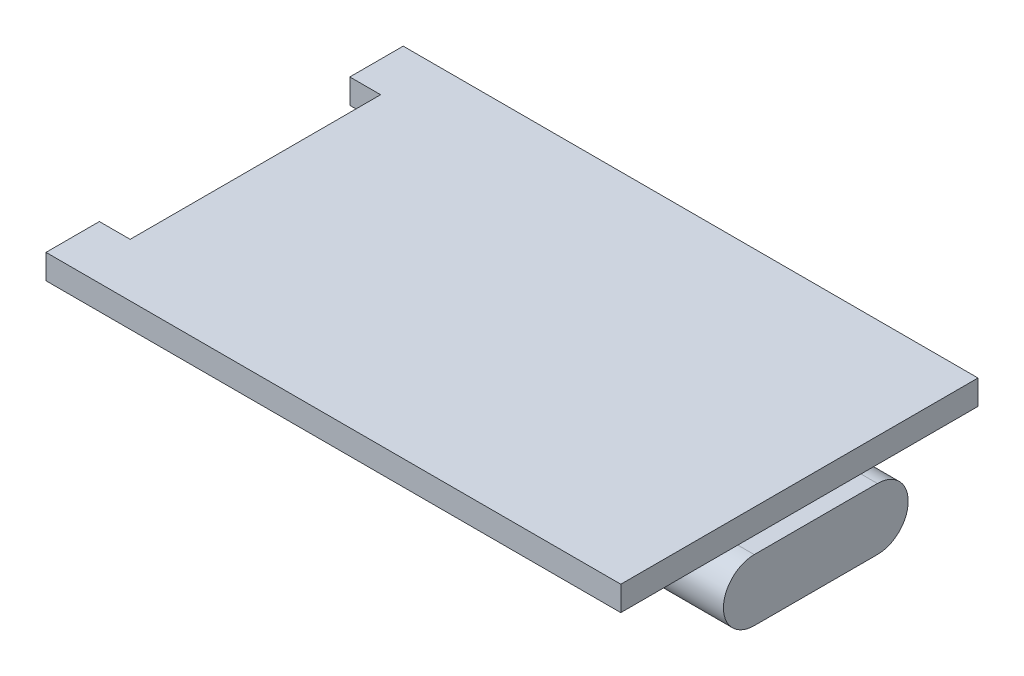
from build123d import *

# Parameters (mm, degrees)
BOSS_EXTRU_1_DEPTH = 6.8
BOSS_EXTRU_2_DEPTH = 1.2


with BuildPart() as part:
    # Esquisse3 → Boss.-Extru.1 (new body)
    with BuildSketch(Plane(origin=(0, 0, 0), x_dir=(0, 0, -1), z_dir=(1, 0, 0))):
        with BuildLine():
            Line((-3, 1.5), (3, 1.5))
            ThreePointArc((3, 1.5), (4.5, 0), (3, -1.5))
            Line((3, -1.5), (-3, -1.5))
            ThreePointArc((-3, -1.5), (-4.5, 0), (-3, 1.5))
        make_face()
    extrude(amount=-BOSS_EXTRU_1_DEPTH)

    # Esquisse1 → Boss.-Extru.2 (add)
    with BuildSketch(Plane(origin=(0, 1.5, 0), x_dir=(1, 0, 0), z_dir=(0, 1, 0))):
        Polygon((-28.8, 8.7), (-0.8, 8.7), (-0.8, -8.7), (-28.8, -8.7), (-28.8, -6.1), (-27.3, -6.1), (-27.3, 6.1), (-28.8, 6.1), align=None)
    extrude(amount=BOSS_EXTRU_2_DEPTH)


solid = part.part
